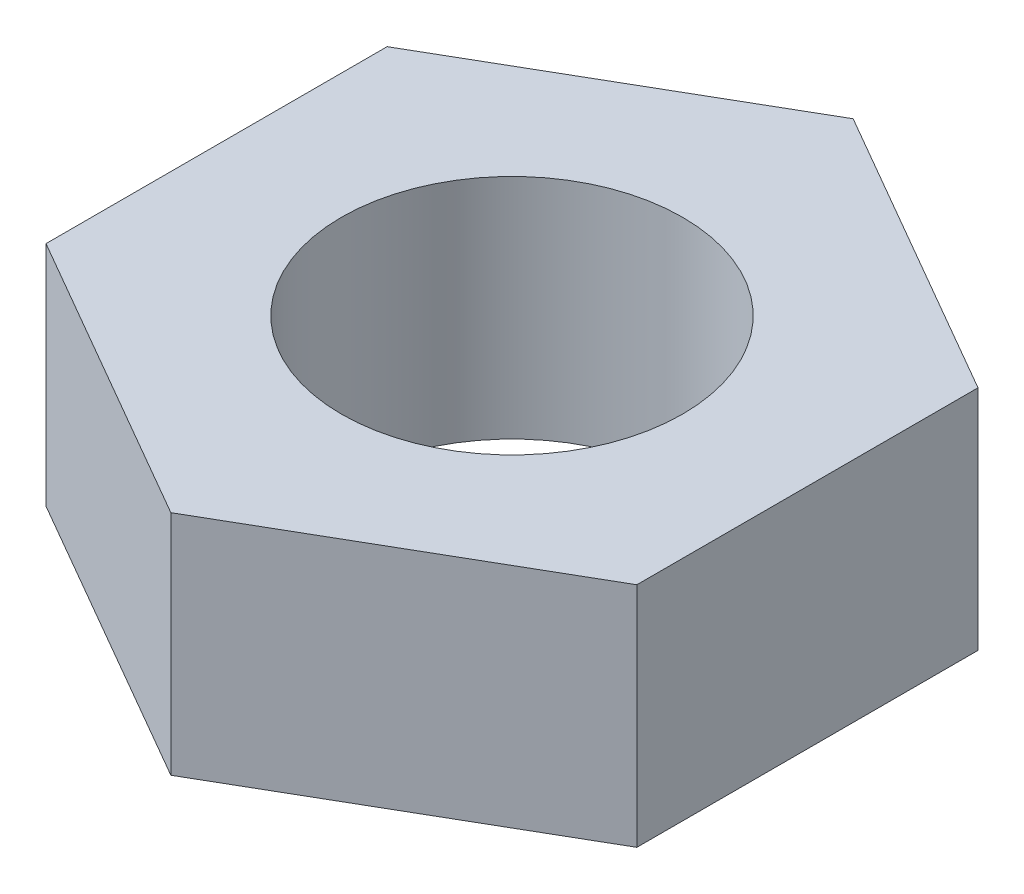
ISO-10303-21;
HEADER;
FILE_DESCRIPTION(('STEP AP214'),'2;1');
FILE_NAME('part.step','',(''),(''),'','','');
FILE_SCHEMA(('AUTOMOTIVE_DESIGN { 1 0 10303 214 1 1 1 1 }'));
ENDSEC;
DATA;
#1=APPLICATION_CONTEXT('core data for automotive mechanical design processes');
#2=APPLICATION_PROTOCOL_DEFINITION('international standard','automotive_design',2000,#1);
#3=PRODUCT_CONTEXT('',#1,'mechanical');
#4=PRODUCT('Part','Part','',(#3));
#5=PRODUCT_RELATED_PRODUCT_CATEGORY('part','',(#4));
#6=PRODUCT_DEFINITION_FORMATION('','',#4);
#7=PRODUCT_DEFINITION_CONTEXT('part definition',#1,'design');
#8=PRODUCT_DEFINITION('design','',#6,#7);
#9=PRODUCT_DEFINITION_SHAPE('','',#8);
#10=(LENGTH_UNIT() NAMED_UNIT(*) SI_UNIT(.MILLI.,.METRE.));
#11=(NAMED_UNIT(*) PLANE_ANGLE_UNIT() SI_UNIT($,.RADIAN.));
#12=(NAMED_UNIT(*) SI_UNIT($,.STERADIAN.) SOLID_ANGLE_UNIT());
#13=UNCERTAINTY_MEASURE_WITH_UNIT(LENGTH_MEASURE(1.E-05),#10,'distance_accuracy_value','');
#14=(GEOMETRIC_REPRESENTATION_CONTEXT(3) GLOBAL_UNCERTAINTY_ASSIGNED_CONTEXT((#13)) GLOBAL_UNIT_ASSIGNED_CONTEXT((#10,
#11,#12)) REPRESENTATION_CONTEXT('',''));
#15=CARTESIAN_POINT('',(0.,0.,0.));
#16=DIRECTION('',(0.,0.,1.));
#17=DIRECTION('',(1.,0.,0.));
#18=AXIS2_PLACEMENT_3D('',#15,#16,#17);
#19=CARTESIAN_POINT('',(12.9903810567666,10.,-7.5));
#20=DIRECTION('',(0.,1.,0.));
#21=DIRECTION('',(0.,0.,1.));
#22=AXIS2_PLACEMENT_3D('',#19,#20,#21);
#23=PLANE('',#22);
#24=DIRECTION('',(0.,0.,-1.));
#25=VECTOR('',#24,1.);
#26=CARTESIAN_POINT('',(12.9903810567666,10.,7.5));
#27=LINE('',#26,#25);
#28=CARTESIAN_POINT('',(12.9903810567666,10.,7.5));
#29=VERTEX_POINT('',#28);
#30=CARTESIAN_POINT('',(12.9903810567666,10.,-7.5));
#31=VERTEX_POINT('',#30);
#32=EDGE_CURVE('E127',#29,#31,#27,.T.);
#33=ORIENTED_EDGE('',*,*,#32,.T.);
#34=DIRECTION('',(-0.866025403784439,0.,-0.5));
#35=VECTOR('',#34,1.);
#36=CARTESIAN_POINT('',(12.9903810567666,10.,-7.5));
#37=LINE('',#36,#35);
#38=CARTESIAN_POINT('',(0.,10.,-15.));
#39=VERTEX_POINT('',#38);
#40=EDGE_CURVE('E85',#31,#39,#37,.T.);
#41=ORIENTED_EDGE('',*,*,#40,.T.);
#42=DIRECTION('',(-0.866025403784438,0.,0.5));
#43=VECTOR('',#42,1.);
#44=CARTESIAN_POINT('',(0.,10.,-15.));
#45=LINE('',#44,#43);
#46=CARTESIAN_POINT('',(-12.9903810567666,10.,-7.5));
#47=VERTEX_POINT('',#46);
#48=EDGE_CURVE('E98',#39,#47,#45,.T.);
#49=ORIENTED_EDGE('',*,*,#48,.T.);
#50=DIRECTION('',(0.,0.,1.));
#51=VECTOR('',#50,1.);
#52=CARTESIAN_POINT('',(-12.9903810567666,10.,-7.5));
#53=LINE('',#52,#51);
#54=CARTESIAN_POINT('',(-12.9903810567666,10.,7.49999999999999));
#55=VERTEX_POINT('',#54);
#56=EDGE_CURVE('E92',#47,#55,#53,.T.);
#57=ORIENTED_EDGE('',*,*,#56,.T.);
#58=DIRECTION('',(0.866025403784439,0.,0.5));
#59=VECTOR('',#58,1.);
#60=CARTESIAN_POINT('',(-12.9903810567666,10.,7.49999999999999));
#61=LINE('',#60,#59);
#62=CARTESIAN_POINT('',(0.,10.,15.));
#63=VERTEX_POINT('',#62);
#64=EDGE_CURVE('E96',#55,#63,#61,.T.);
#65=ORIENTED_EDGE('',*,*,#64,.T.);
#66=DIRECTION('',(0.866025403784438,0.,-0.5));
#67=VECTOR('',#66,1.);
#68=CARTESIAN_POINT('',(0.,10.,15.));
#69=LINE('',#68,#67);
#70=EDGE_CURVE('E48',#63,#29,#69,.T.);
#71=ORIENTED_EDGE('',*,*,#70,.T.);
#72=EDGE_LOOP('',(#33,#41,#49,#57,#65,#71));
#73=FACE_BOUND('',#72,.T.);
#74=CARTESIAN_POINT('',(0.,10.,0.));
#75=DIRECTION('',(0.,1.,0.));
#76=DIRECTION('',(0.,0.,1.));
#77=AXIS2_PLACEMENT_3D('',#74,#75,#76);
#78=CIRCLE('',#77,7.5);
#79=CARTESIAN_POINT('',(0.,10.,7.5));
#80=VERTEX_POINT('',#79);
#81=EDGE_CURVE('E120',#80,#80,#78,.T.);
#82=ORIENTED_EDGE('',*,*,#81,.F.);
#83=EDGE_LOOP('',(#82));
#84=FACE_BOUND('',#83,.T.);
#85=ADVANCED_FACE('F31',(#73,#84),#23,.T.);
#86=CARTESIAN_POINT('',(12.9903810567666,0.,-7.5));
#87=DIRECTION('',(0.,1.,0.));
#88=DIRECTION('',(0.,0.,1.));
#89=AXIS2_PLACEMENT_3D('',#86,#87,#88);
#90=PLANE('',#89);
#91=DIRECTION('',(0.,0.,-1.));
#92=VECTOR('',#91,1.);
#93=CARTESIAN_POINT('',(12.9903810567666,0.,7.5));
#94=LINE('',#93,#92);
#95=CARTESIAN_POINT('',(12.9903810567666,0.,7.5));
#96=VERTEX_POINT('',#95);
#97=CARTESIAN_POINT('',(12.9903810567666,0.,-7.5));
#98=VERTEX_POINT('',#97);
#99=EDGE_CURVE('E116',#96,#98,#94,.T.);
#100=ORIENTED_EDGE('',*,*,#99,.F.);
#101=DIRECTION('',(0.866025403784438,0.,-0.5));
#102=VECTOR('',#101,1.);
#103=CARTESIAN_POINT('',(0.,0.,15.));
#104=LINE('',#103,#102);
#105=CARTESIAN_POINT('',(0.,0.,15.));
#106=VERTEX_POINT('',#105);
#107=EDGE_CURVE('E77',#106,#96,#104,.T.);
#108=ORIENTED_EDGE('',*,*,#107,.F.);
#109=DIRECTION('',(0.866025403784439,0.,0.5));
#110=VECTOR('',#109,1.);
#111=CARTESIAN_POINT('',(-12.9903810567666,0.,7.49999999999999));
#112=LINE('',#111,#110);
#113=CARTESIAN_POINT('',(-12.9903810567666,0.,7.49999999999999));
#114=VERTEX_POINT('',#113);
#115=EDGE_CURVE('E71',#114,#106,#112,.T.);
#116=ORIENTED_EDGE('',*,*,#115,.F.);
#117=DIRECTION('',(0.,0.,1.));
#118=VECTOR('',#117,1.);
#119=CARTESIAN_POINT('',(-12.9903810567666,0.,-7.5));
#120=LINE('',#119,#118);
#121=CARTESIAN_POINT('',(-12.9903810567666,0.,-7.5));
#122=VERTEX_POINT('',#121);
#123=EDGE_CURVE('E106',#122,#114,#120,.T.);
#124=ORIENTED_EDGE('',*,*,#123,.F.);
#125=DIRECTION('',(-0.866025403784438,0.,0.5));
#126=VECTOR('',#125,1.);
#127=CARTESIAN_POINT('',(0.,0.,-15.));
#128=LINE('',#127,#126);
#129=CARTESIAN_POINT('',(0.,0.,-15.));
#130=VERTEX_POINT('',#129);
#131=EDGE_CURVE('E122',#130,#122,#128,.T.);
#132=ORIENTED_EDGE('',*,*,#131,.F.);
#133=DIRECTION('',(-0.866025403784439,0.,-0.5));
#134=VECTOR('',#133,1.);
#135=CARTESIAN_POINT('',(12.9903810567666,0.,-7.5));
#136=LINE('',#135,#134);
#137=EDGE_CURVE('E119',#98,#130,#136,.T.);
#138=ORIENTED_EDGE('',*,*,#137,.F.);
#139=EDGE_LOOP('',(#100,#108,#116,#124,#132,#138));
#140=FACE_BOUND('',#139,.T.);
#141=CARTESIAN_POINT('',(0.,0.,0.));
#142=DIRECTION('',(0.,1.,0.));
#143=DIRECTION('',(0.,0.,1.));
#144=AXIS2_PLACEMENT_3D('',#141,#142,#143);
#145=CIRCLE('',#144,7.5);
#146=CARTESIAN_POINT('',(0.,0.,7.5));
#147=VERTEX_POINT('',#146);
#148=EDGE_CURVE('E220',#147,#147,#145,.T.);
#149=ORIENTED_EDGE('',*,*,#148,.T.);
#150=EDGE_LOOP('',(#149));
#151=FACE_BOUND('',#150,.T.);
#152=ADVANCED_FACE('F136',(#140,#151),#90,.F.);
#153=CARTESIAN_POINT('',(12.9903810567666,10.,7.5));
#154=DIRECTION('',(-1.,0.,0.));
#155=DIRECTION('',(0.,0.,1.));
#156=AXIS2_PLACEMENT_3D('',#153,#154,#155);
#157=PLANE('',#156);
#158=ORIENTED_EDGE('',*,*,#99,.T.);
#159=DIRECTION('',(0.,-1.,0.));
#160=VECTOR('',#159,1.);
#161=CARTESIAN_POINT('',(12.9903810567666,10.,-7.5));
#162=LINE('',#161,#160);
#163=EDGE_CURVE('E11',#31,#98,#162,.T.);
#164=ORIENTED_EDGE('',*,*,#163,.F.);
#165=ORIENTED_EDGE('',*,*,#32,.F.);
#166=DIRECTION('',(0.,-1.,0.));
#167=VECTOR('',#166,1.);
#168=CARTESIAN_POINT('',(12.9903810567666,10.,7.5));
#169=LINE('',#168,#167);
#170=EDGE_CURVE('E112',#29,#96,#169,.T.);
#171=ORIENTED_EDGE('',*,*,#170,.T.);
#172=EDGE_LOOP('',(#158,#164,#165,#171));
#173=FACE_BOUND('',#172,.T.);
#174=ADVANCED_FACE('F33',(#173),#157,.F.);
#175=CARTESIAN_POINT('',(12.9903810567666,10.,-7.5));
#176=DIRECTION('',(-0.5,0.,0.866025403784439));
#177=DIRECTION('',(0.866025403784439,0.,0.5));
#178=AXIS2_PLACEMENT_3D('',#175,#176,#177);
#179=PLANE('',#178);
#180=ORIENTED_EDGE('',*,*,#137,.T.);
#181=DIRECTION('',(0.,-1.,0.));
#182=VECTOR('',#181,1.);
#183=CARTESIAN_POINT('',(0.,10.,-15.));
#184=LINE('',#183,#182);
#185=EDGE_CURVE('E40',#39,#130,#184,.T.);
#186=ORIENTED_EDGE('',*,*,#185,.F.);
#187=ORIENTED_EDGE('',*,*,#40,.F.);
#188=ORIENTED_EDGE('',*,*,#163,.T.);
#189=EDGE_LOOP('',(#180,#186,#187,#188));
#190=FACE_BOUND('',#189,.T.);
#191=ADVANCED_FACE('F161',(#190),#179,.F.);
#192=CARTESIAN_POINT('',(0.,10.,-15.));
#193=DIRECTION('',(0.5,0.,0.866025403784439));
#194=DIRECTION('',(0.866025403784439,0.,-0.5));
#195=AXIS2_PLACEMENT_3D('',#192,#193,#194);
#196=PLANE('',#195);
#197=ORIENTED_EDGE('',*,*,#131,.T.);
#198=DIRECTION('',(0.,-1.,0.));
#199=VECTOR('',#198,1.);
#200=CARTESIAN_POINT('',(-12.9903810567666,10.,-7.5));
#201=LINE('',#200,#199);
#202=EDGE_CURVE('E107',#47,#122,#201,.T.);
#203=ORIENTED_EDGE('',*,*,#202,.F.);
#204=ORIENTED_EDGE('',*,*,#48,.F.);
#205=ORIENTED_EDGE('',*,*,#185,.T.);
#206=EDGE_LOOP('',(#197,#203,#204,#205));
#207=FACE_BOUND('',#206,.T.);
#208=ADVANCED_FACE('F133',(#207),#196,.F.);
#209=CARTESIAN_POINT('',(-12.9903810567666,10.,-7.5));
#210=DIRECTION('',(1.,0.,0.));
#211=DIRECTION('',(0.,0.,-1.));
#212=AXIS2_PLACEMENT_3D('',#209,#210,#211);
#213=PLANE('',#212);
#214=ORIENTED_EDGE('',*,*,#123,.T.);
#215=DIRECTION('',(0.,-1.,0.));
#216=VECTOR('',#215,1.);
#217=CARTESIAN_POINT('',(-12.9903810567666,10.,7.49999999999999));
#218=LINE('',#217,#216);
#219=EDGE_CURVE('E103',#55,#114,#218,.T.);
#220=ORIENTED_EDGE('',*,*,#219,.F.);
#221=ORIENTED_EDGE('',*,*,#56,.F.);
#222=ORIENTED_EDGE('',*,*,#202,.T.);
#223=EDGE_LOOP('',(#214,#220,#221,#222));
#224=FACE_BOUND('',#223,.T.);
#225=ADVANCED_FACE('F104',(#224),#213,.F.);
#226=CARTESIAN_POINT('',(-12.9903810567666,10.,7.49999999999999));
#227=DIRECTION('',(0.5,0.,-0.866025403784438));
#228=DIRECTION('',(-0.866025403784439,0.,-0.5));
#229=AXIS2_PLACEMENT_3D('',#226,#227,#228);
#230=PLANE('',#229);
#231=ORIENTED_EDGE('',*,*,#115,.T.);
#232=DIRECTION('',(0.,-1.,0.));
#233=VECTOR('',#232,1.);
#234=CARTESIAN_POINT('',(0.,10.,15.));
#235=LINE('',#234,#233);
#236=EDGE_CURVE('E108',#63,#106,#235,.T.);
#237=ORIENTED_EDGE('',*,*,#236,.F.);
#238=ORIENTED_EDGE('',*,*,#64,.F.);
#239=ORIENTED_EDGE('',*,*,#219,.T.);
#240=EDGE_LOOP('',(#231,#237,#238,#239));
#241=FACE_BOUND('',#240,.T.);
#242=ADVANCED_FACE('F110',(#241),#230,.F.);
#243=CARTESIAN_POINT('',(0.,10.,15.));
#244=DIRECTION('',(-0.5,0.,-0.866025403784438));
#245=DIRECTION('',(-0.866025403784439,0.,0.5));
#246=AXIS2_PLACEMENT_3D('',#243,#244,#245);
#247=PLANE('',#246);
#248=ORIENTED_EDGE('',*,*,#107,.T.);
#249=ORIENTED_EDGE('',*,*,#170,.F.);
#250=ORIENTED_EDGE('',*,*,#70,.F.);
#251=ORIENTED_EDGE('',*,*,#236,.T.);
#252=EDGE_LOOP('',(#248,#249,#250,#251));
#253=FACE_BOUND('',#252,.T.);
#254=ADVANCED_FACE('F141',(#253),#247,.F.);
#255=CARTESIAN_POINT('',(0.,10.,0.));
#256=DIRECTION('',(0.,-1.,0.));
#257=DIRECTION('',(0.,0.,-1.));
#258=AXIS2_PLACEMENT_3D('',#255,#256,#257);
#259=CYLINDRICAL_SURFACE('',#258,7.5);
#260=ORIENTED_EDGE('',*,*,#81,.T.);
#261=EDGE_LOOP('',(#260));
#262=FACE_BOUND('',#261,.T.);
#263=ORIENTED_EDGE('',*,*,#148,.F.);
#264=EDGE_LOOP('',(#263));
#265=FACE_BOUND('',#264,.T.);
#266=ADVANCED_FACE('F143',(#262,#265),#259,.F.);
#267=CLOSED_SHELL('',(#85,#152,#174,#191,#208,#225,#242,#254,#266));
#268=MANIFOLD_SOLID_BREP('B2',#267);
#269=ADVANCED_BREP_SHAPE_REPRESENTATION('',(#18,#268),#14);
#270=SHAPE_DEFINITION_REPRESENTATION(#9,#269);
ENDSEC;
END-ISO-10303-21;
